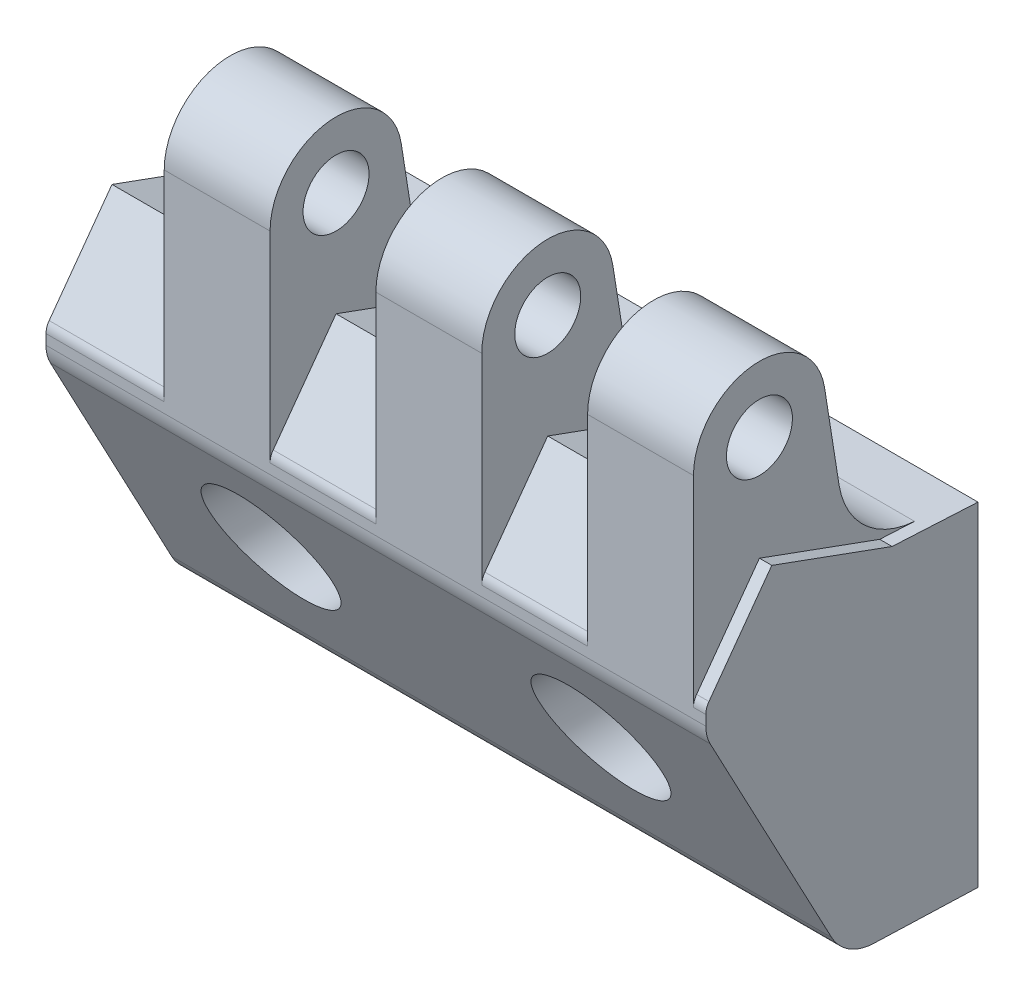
ISO-10303-21;
HEADER;
FILE_DESCRIPTION(('STEP AP214'),'2;1');
FILE_NAME('part.step','',(''),(''),'','','');
FILE_SCHEMA(('AUTOMOTIVE_DESIGN { 1 0 10303 214 1 1 1 1 }'));
ENDSEC;
DATA;
#1=APPLICATION_CONTEXT('core data for automotive mechanical design processes');
#2=APPLICATION_PROTOCOL_DEFINITION('international standard','automotive_design',2000,#1);
#3=PRODUCT_CONTEXT('',#1,'mechanical');
#4=PRODUCT('Part','Part','',(#3));
#5=PRODUCT_RELATED_PRODUCT_CATEGORY('part','',(#4));
#6=PRODUCT_DEFINITION_FORMATION('','',#4);
#7=PRODUCT_DEFINITION_CONTEXT('part definition',#1,'design');
#8=PRODUCT_DEFINITION('design','',#6,#7);
#9=PRODUCT_DEFINITION_SHAPE('','',#8);
#10=(LENGTH_UNIT() NAMED_UNIT(*) SI_UNIT(.MILLI.,.METRE.));
#11=(NAMED_UNIT(*) PLANE_ANGLE_UNIT() SI_UNIT($,.RADIAN.));
#12=(NAMED_UNIT(*) SI_UNIT($,.STERADIAN.) SOLID_ANGLE_UNIT());
#13=UNCERTAINTY_MEASURE_WITH_UNIT(LENGTH_MEASURE(1.E-05),#10,'distance_accuracy_value','');
#14=(GEOMETRIC_REPRESENTATION_CONTEXT(3) GLOBAL_UNCERTAINTY_ASSIGNED_CONTEXT((#13)) GLOBAL_UNIT_ASSIGNED_CONTEXT((#10,
#11,#12)) REPRESENTATION_CONTEXT('',''));
#15=CARTESIAN_POINT('',(0.,0.,0.));
#16=DIRECTION('',(0.,0.,1.));
#17=DIRECTION('',(1.,0.,0.));
#18=AXIS2_PLACEMENT_3D('',#15,#16,#17);
#19=CARTESIAN_POINT('',(-10.25,10.93,0.));
#20=DIRECTION('',(0.,0.998629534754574,-0.0523359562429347));
#21=DIRECTION('',(0.,0.0523359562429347,0.998629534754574));
#22=AXIS2_PLACEMENT_3D('',#19,#20,#21);
#23=PLANE('',#22);
#24=DIRECTION('',(1.,0.,0.));
#25=VECTOR('',#24,1.);
#26=CARTESIAN_POINT('',(-10.25,10.93,0.));
#27=LINE('',#26,#25);
#28=CARTESIAN_POINT('',(-10.,10.93,0.));
#29=VERTEX_POINT('',#28);
#30=CARTESIAN_POINT('',(30.,10.93,0.));
#31=VERTEX_POINT('',#30);
#32=EDGE_CURVE('E261',#29,#31,#27,.T.);
#33=ORIENTED_EDGE('',*,*,#32,.F.);
#34=DIRECTION('',(0.,-0.0523359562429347,-0.998629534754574));
#35=VECTOR('',#34,1.);
#36=CARTESIAN_POINT('',(-10.,11.2029078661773,5.2073922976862));
#37=LINE('',#36,#35);
#38=CARTESIAN_POINT('',(-10.,11.2029078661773,5.2073922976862));
#39=VERTEX_POINT('',#38);
#40=EDGE_CURVE('E243',#39,#29,#37,.T.);
#41=ORIENTED_EDGE('',*,*,#40,.F.);
#42=DIRECTION('',(1.,0.,0.));
#43=VECTOR('',#42,1.);
#44=CARTESIAN_POINT('',(-10.25,11.2029078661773,5.2073922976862));
#45=LINE('',#44,#43);
#46=CARTESIAN_POINT('',(-2.8333333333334,11.2029078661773,5.2073922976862));
#47=VERTEX_POINT('',#46);
#48=EDGE_CURVE('E265',#39,#47,#45,.T.);
#49=ORIENTED_EDGE('',*,*,#48,.T.);
#50=DIRECTION('',(0.,0.0523359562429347,0.998629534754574));
#51=VECTOR('',#50,1.);
#52=CARTESIAN_POINT('',(-2.8333333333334,10.93,0.));
#53=LINE('',#52,#51);
#54=CARTESIAN_POINT('',(-2.8333333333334,11.0922838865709,3.09656102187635));
#55=VERTEX_POINT('',#54);
#56=EDGE_CURVE('E409',#55,#47,#53,.T.);
#57=ORIENTED_EDGE('',*,*,#56,.F.);
#58=DIRECTION('',(1.,0.,0.));
#59=VECTOR('',#58,1.);
#60=CARTESIAN_POINT('',(-2.8333333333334,11.0922838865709,3.09656102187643));
#61=LINE('',#60,#59);
#62=CARTESIAN_POINT('',(3.5833333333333,11.0922838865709,3.09656102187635));
#63=VERTEX_POINT('',#62);
#64=EDGE_CURVE('E263',#63,#55,#61,.F.);
#65=ORIENTED_EDGE('',*,*,#64,.F.);
#66=DIRECTION('',(0.,0.0523359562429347,0.998629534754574));
#67=VECTOR('',#66,1.);
#68=CARTESIAN_POINT('',(3.5833333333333,10.93,0.));
#69=LINE('',#68,#67);
#70=CARTESIAN_POINT('',(3.5833333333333,11.2029078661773,5.2073922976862));
#71=VERTEX_POINT('',#70);
#72=EDGE_CURVE('E397',#63,#71,#69,.T.);
#73=ORIENTED_EDGE('',*,*,#72,.T.);
#74=CARTESIAN_POINT('',(10.,11.2029078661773,5.2073922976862));
#75=VERTEX_POINT('',#74);
#76=EDGE_CURVE('E311',#71,#75,#45,.T.);
#77=ORIENTED_EDGE('',*,*,#76,.T.);
#78=DIRECTION('',(0.,0.0523359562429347,0.998629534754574));
#79=VECTOR('',#78,1.);
#80=CARTESIAN_POINT('',(10.,10.93,0.));
#81=LINE('',#80,#79);
#82=CARTESIAN_POINT('',(10.,11.0922838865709,3.09656102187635));
#83=VERTEX_POINT('',#82);
#84=EDGE_CURVE('E458',#83,#75,#81,.T.);
#85=ORIENTED_EDGE('',*,*,#84,.F.);
#86=DIRECTION('',(-1.,0.,0.));
#87=VECTOR('',#86,1.);
#88=CARTESIAN_POINT('',(16.4166666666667,11.0922838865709,3.09656102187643));
#89=LINE('',#88,#87);
#90=CARTESIAN_POINT('',(16.4166666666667,11.0922838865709,3.09656102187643));
#91=VERTEX_POINT('',#90);
#92=EDGE_CURVE('E260',#83,#91,#89,.F.);
#93=ORIENTED_EDGE('',*,*,#92,.T.);
#94=DIRECTION('',(0.,0.0523359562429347,0.998629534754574));
#95=VECTOR('',#94,1.);
#96=CARTESIAN_POINT('',(16.4166666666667,10.93,0.));
#97=LINE('',#96,#95);
#98=CARTESIAN_POINT('',(16.4166666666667,11.2029078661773,5.2073922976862));
#99=VERTEX_POINT('',#98);
#100=EDGE_CURVE('E324',#91,#99,#97,.T.);
#101=ORIENTED_EDGE('',*,*,#100,.T.);
#102=CARTESIAN_POINT('',(22.833333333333,11.2029078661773,5.2073922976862));
#103=VERTEX_POINT('',#102);
#104=EDGE_CURVE('E312',#99,#103,#45,.T.);
#105=ORIENTED_EDGE('',*,*,#104,.T.);
#106=DIRECTION('',(0.,0.0523359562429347,0.998629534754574));
#107=VECTOR('',#106,1.);
#108=CARTESIAN_POINT('',(22.833333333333,10.93,0.));
#109=LINE('',#108,#107);
#110=CARTESIAN_POINT('',(22.833333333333,11.0922838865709,3.09656102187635));
#111=VERTEX_POINT('',#110);
#112=EDGE_CURVE('E321',#111,#103,#109,.T.);
#113=ORIENTED_EDGE('',*,*,#112,.F.);
#114=DIRECTION('',(-1.,0.,0.));
#115=VECTOR('',#114,1.);
#116=CARTESIAN_POINT('',(29.25,11.0922838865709,3.09656102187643));
#117=LINE('',#116,#115);
#118=CARTESIAN_POINT('',(29.25,11.0922838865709,3.09656102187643));
#119=VERTEX_POINT('',#118);
#120=EDGE_CURVE('E270',#111,#119,#117,.F.);
#121=ORIENTED_EDGE('',*,*,#120,.T.);
#122=DIRECTION('',(0.,0.0523359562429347,0.998629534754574));
#123=VECTOR('',#122,1.);
#124=CARTESIAN_POINT('',(29.25,10.93,0.));
#125=LINE('',#124,#123);
#126=CARTESIAN_POINT('',(29.25,11.2029078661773,5.2073922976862));
#127=VERTEX_POINT('',#126);
#128=EDGE_CURVE('E347',#119,#127,#125,.T.);
#129=ORIENTED_EDGE('',*,*,#128,.T.);
#130=CARTESIAN_POINT('',(30.,11.2029078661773,5.2073922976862));
#131=VERTEX_POINT('',#130);
#132=EDGE_CURVE('E308',#127,#131,#45,.T.);
#133=ORIENTED_EDGE('',*,*,#132,.T.);
#134=DIRECTION('',(0.,0.0523359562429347,0.998629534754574));
#135=VECTOR('',#134,1.);
#136=CARTESIAN_POINT('',(30.,10.93,0.));
#137=LINE('',#136,#135);
#138=EDGE_CURVE('E476',#31,#131,#137,.T.);
#139=ORIENTED_EDGE('',*,*,#138,.F.);
#140=EDGE_LOOP('',(#33,#41,#49,#57,#65,#73,#77,#85,#93,#101,#105,#113,#121,#129,#133,#139));
#141=FACE_BOUND('',#140,.T.);
#142=ADVANCED_FACE('F16',(#141),#23,.T.);
#143=CARTESIAN_POINT('',(-10.25,-9.07892726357,6.330694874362));
#144=DIRECTION('',(0.,-0.999390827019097,0.0348994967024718));
#145=DIRECTION('',(0.,-0.0348994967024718,-0.999390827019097));
#146=AXIS2_PLACEMENT_3D('',#143,#144,#145);
#147=PLANE('',#146);
#148=DIRECTION('',(1.,0.,0.));
#149=VECTOR('',#148,1.);
#150=CARTESIAN_POINT('',(-10.25,-9.07892726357,6.330694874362));
#151=LINE('',#150,#149);
#152=CARTESIAN_POINT('',(-10.,-9.07892726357,6.330694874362));
#153=VERTEX_POINT('',#152);
#154=CARTESIAN_POINT('',(30.,-9.07892726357,6.330694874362));
#155=VERTEX_POINT('',#154);
#156=EDGE_CURVE('E253',#153,#155,#151,.T.);
#157=ORIENTED_EDGE('',*,*,#156,.F.);
#158=DIRECTION('',(0.,0.0348994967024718,0.999390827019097));
#159=VECTOR('',#158,1.);
#160=CARTESIAN_POINT('',(-10.,-9.3,0.));
#161=LINE('',#160,#159);
#162=CARTESIAN_POINT('',(-10.,-9.3,0.));
#163=VERTEX_POINT('',#162);
#164=EDGE_CURVE('E240',#163,#153,#161,.T.);
#165=ORIENTED_EDGE('',*,*,#164,.F.);
#166=DIRECTION('',(1.,0.,0.));
#167=VECTOR('',#166,1.);
#168=CARTESIAN_POINT('',(-10.25,-9.3,0.));
#169=LINE('',#168,#167);
#170=CARTESIAN_POINT('',(30.,-9.3,0.));
#171=VERTEX_POINT('',#170);
#172=EDGE_CURVE('E251',#163,#171,#169,.T.);
#173=ORIENTED_EDGE('',*,*,#172,.T.);
#174=DIRECTION('',(0.,-0.0348994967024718,-0.999390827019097));
#175=VECTOR('',#174,1.);
#176=CARTESIAN_POINT('',(30.,-9.07892726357,6.330694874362));
#177=LINE('',#176,#175);
#178=EDGE_CURVE('E473',#155,#171,#177,.T.);
#179=ORIENTED_EDGE('',*,*,#178,.F.);
#180=EDGE_LOOP('',(#157,#165,#173,#179));
#181=FACE_BOUND('',#180,.T.);
#182=ADVANCED_FACE('F18',(#181),#147,.T.);
#183=CARTESIAN_POINT('',(-10.25,-9.3,0.));
#184=DIRECTION('',(0.,0.,-1.));
#185=DIRECTION('',(-1.,0.,0.));
#186=AXIS2_PLACEMENT_3D('',#183,#184,#185);
#187=PLANE('',#186);
#188=CARTESIAN_POINT('',(0.,0.,0.));
#189=DIRECTION('',(0.,0.,1.));
#190=DIRECTION('',(0.,-1.,0.));
#191=AXIS2_PLACEMENT_3D('',#188,#189,#190);
#192=CIRCLE('',#191,2.25);
#193=CARTESIAN_POINT('',(0.,-2.25,0.));
#194=VERTEX_POINT('',#193);
#195=EDGE_CURVE('E492',#194,#194,#192,.T.);
#196=ORIENTED_EDGE('',*,*,#195,.T.);
#197=EDGE_LOOP('',(#196));
#198=FACE_BOUND('',#197,.T.);
#199=CARTESIAN_POINT('',(20.,0.,0.));
#200=DIRECTION('',(0.,0.,1.));
#201=DIRECTION('',(0.,-1.,0.));
#202=AXIS2_PLACEMENT_3D('',#199,#200,#201);
#203=CIRCLE('',#202,2.25);
#204=CARTESIAN_POINT('',(20.,-2.25,0.));
#205=VERTEX_POINT('',#204);
#206=EDGE_CURVE('E502',#205,#205,#203,.T.);
#207=ORIENTED_EDGE('',*,*,#206,.T.);
#208=EDGE_LOOP('',(#207));
#209=FACE_BOUND('',#208,.T.);
#210=ORIENTED_EDGE('',*,*,#172,.F.);
#211=DIRECTION('',(0.,-1.,0.));
#212=VECTOR('',#211,1.);
#213=CARTESIAN_POINT('',(-10.,10.93,0.));
#214=LINE('',#213,#212);
#215=EDGE_CURVE('E237',#29,#163,#214,.T.);
#216=ORIENTED_EDGE('',*,*,#215,.F.);
#217=ORIENTED_EDGE('',*,*,#32,.T.);
#218=DIRECTION('',(0.,1.,0.));
#219=VECTOR('',#218,1.);
#220=CARTESIAN_POINT('',(30.,-9.3,0.));
#221=LINE('',#220,#219);
#222=EDGE_CURVE('E259',#171,#31,#221,.T.);
#223=ORIENTED_EDGE('',*,*,#222,.F.);
#224=EDGE_LOOP('',(#210,#216,#217,#223));
#225=FACE_BOUND('',#224,.T.);
#226=ADVANCED_FACE('F257',(#198,#209,#225),#187,.T.);
#227=CARTESIAN_POINT('',(-10.25,8.026752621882,16.5));
#228=DIRECTION('',(0.,0.,1.));
#229=DIRECTION('',(1.,0.,0.));
#230=AXIS2_PLACEMENT_3D('',#227,#228,#229);
#231=PLANE('',#230);
#232=DIRECTION('',(1.,0.,0.));
#233=VECTOR('',#232,1.);
#234=CARTESIAN_POINT('',(-10.25,8.026752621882,16.5));
#235=LINE('',#234,#233);
#236=CARTESIAN_POINT('',(-10.,8.026752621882,16.5));
#237=VERTEX_POINT('',#236);
#238=CARTESIAN_POINT('',(-2.8333333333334,8.026752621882,16.5));
#239=VERTEX_POINT('',#238);
#240=EDGE_CURVE('E297',#237,#239,#235,.T.);
#241=ORIENTED_EDGE('',*,*,#240,.F.);
#242=DIRECTION('',(0.,1.,0.));
#243=VECTOR('',#242,1.);
#244=CARTESIAN_POINT('',(-10.,7.41266032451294,16.5));
#245=LINE('',#244,#243);
#246=CARTESIAN_POINT('',(-10.,7.41266032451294,16.5));
#247=VERTEX_POINT('',#246);
#248=EDGE_CURVE('E31',#247,#237,#245,.T.);
#249=ORIENTED_EDGE('',*,*,#248,.F.);
#250=DIRECTION('',(1.,0.,0.));
#251=VECTOR('',#250,1.);
#252=CARTESIAN_POINT('',(-10.25,7.412660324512,16.5));
#253=LINE('',#252,#251);
#254=CARTESIAN_POINT('',(30.,7.412660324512,16.5));
#255=VERTEX_POINT('',#254);
#256=EDGE_CURVE('E290',#247,#255,#253,.T.);
#257=ORIENTED_EDGE('',*,*,#256,.T.);
#258=DIRECTION('',(0.,-1.,0.));
#259=VECTOR('',#258,1.);
#260=CARTESIAN_POINT('',(30.,8.026752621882,16.5));
#261=LINE('',#260,#259);
#262=CARTESIAN_POINT('',(30.,8.026752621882,16.5));
#263=VERTEX_POINT('',#262);
#264=EDGE_CURVE('E487',#263,#255,#261,.T.);
#265=ORIENTED_EDGE('',*,*,#264,.F.);
#266=CARTESIAN_POINT('',(29.25,8.026752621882,16.5));
#267=VERTEX_POINT('',#266);
#268=EDGE_CURVE('E292',#267,#263,#235,.T.);
#269=ORIENTED_EDGE('',*,*,#268,.F.);
#270=DIRECTION('',(0.,-1.,0.));
#271=VECTOR('',#270,1.);
#272=CARTESIAN_POINT('',(29.25,20.2,16.5));
#273=LINE('',#272,#271);
#274=CARTESIAN_POINT('',(29.25,20.2,16.5));
#275=VERTEX_POINT('',#274);
#276=EDGE_CURVE('E527',#275,#267,#273,.T.);
#277=ORIENTED_EDGE('',*,*,#276,.F.);
#278=DIRECTION('',(-1.,0.,0.));
#279=VECTOR('',#278,1.);
#280=CARTESIAN_POINT('',(29.25,20.2,16.5));
#281=LINE('',#280,#279);
#282=CARTESIAN_POINT('',(22.833333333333,20.2,16.5));
#283=VERTEX_POINT('',#282);
#284=EDGE_CURVE('E539',#275,#283,#281,.T.);
#285=ORIENTED_EDGE('',*,*,#284,.T.);
#286=DIRECTION('',(0.,-1.,0.));
#287=VECTOR('',#286,1.);
#288=CARTESIAN_POINT('',(22.833333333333,20.2,16.5));
#289=LINE('',#288,#287);
#290=CARTESIAN_POINT('',(22.833333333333,8.026752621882,16.5));
#291=VERTEX_POINT('',#290);
#292=EDGE_CURVE('E511',#283,#291,#289,.T.);
#293=ORIENTED_EDGE('',*,*,#292,.T.);
#294=CARTESIAN_POINT('',(16.4166666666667,8.026752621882,16.5));
#295=VERTEX_POINT('',#294);
#296=EDGE_CURVE('E301',#295,#291,#235,.T.);
#297=ORIENTED_EDGE('',*,*,#296,.F.);
#298=DIRECTION('',(0.,-1.,0.));
#299=VECTOR('',#298,1.);
#300=CARTESIAN_POINT('',(16.4166666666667,20.2,16.5));
#301=LINE('',#300,#299);
#302=CARTESIAN_POINT('',(16.4166666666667,20.2,16.5));
#303=VERTEX_POINT('',#302);
#304=EDGE_CURVE('E428',#303,#295,#301,.T.);
#305=ORIENTED_EDGE('',*,*,#304,.F.);
#306=DIRECTION('',(-1.,0.,0.));
#307=VECTOR('',#306,1.);
#308=CARTESIAN_POINT('',(16.4166666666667,20.2,16.5));
#309=LINE('',#308,#307);
#310=CARTESIAN_POINT('',(10.,20.2,16.5));
#311=VERTEX_POINT('',#310);
#312=EDGE_CURVE('E440',#303,#311,#309,.T.);
#313=ORIENTED_EDGE('',*,*,#312,.T.);
#314=DIRECTION('',(0.,-1.,0.));
#315=VECTOR('',#314,1.);
#316=CARTESIAN_POINT('',(10.,20.2,16.5));
#317=LINE('',#316,#315);
#318=CARTESIAN_POINT('',(10.,8.026752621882,16.5));
#319=VERTEX_POINT('',#318);
#320=EDGE_CURVE('E411',#311,#319,#317,.T.);
#321=ORIENTED_EDGE('',*,*,#320,.T.);
#322=CARTESIAN_POINT('',(3.5833333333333,8.026752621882,16.5));
#323=VERTEX_POINT('',#322);
#324=EDGE_CURVE('E300',#323,#319,#235,.T.);
#325=ORIENTED_EDGE('',*,*,#324,.F.);
#326=DIRECTION('',(0.,-1.,0.));
#327=VECTOR('',#326,1.);
#328=CARTESIAN_POINT('',(3.5833333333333,20.2,16.5));
#329=LINE('',#328,#327);
#330=CARTESIAN_POINT('',(3.5833333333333,20.2,16.5));
#331=VERTEX_POINT('',#330);
#332=EDGE_CURVE('E349',#331,#323,#329,.T.);
#333=ORIENTED_EDGE('',*,*,#332,.F.);
#334=DIRECTION('',(1.,0.,0.));
#335=VECTOR('',#334,1.);
#336=CARTESIAN_POINT('',(-2.8333333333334,20.2,16.5));
#337=LINE('',#336,#335);
#338=CARTESIAN_POINT('',(-2.8333333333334,20.2,16.5));
#339=VERTEX_POINT('',#338);
#340=EDGE_CURVE('E381',#339,#331,#337,.T.);
#341=ORIENTED_EDGE('',*,*,#340,.F.);
#342=DIRECTION('',(0.,-1.,0.));
#343=VECTOR('',#342,1.);
#344=CARTESIAN_POINT('',(-2.8333333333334,20.2,16.5));
#345=LINE('',#344,#343);
#346=EDGE_CURVE('E367',#339,#239,#345,.T.);
#347=ORIENTED_EDGE('',*,*,#346,.T.);
#348=EDGE_LOOP('',(#241,#249,#257,#265,#269,#277,#285,#293,#297,#305,#313,#321,#325,#333,#341,#347));
#349=FACE_BOUND('',#348,.T.);
#350=ADVANCED_FACE('F586',(#349),#231,.T.);
#351=CARTESIAN_POINT('',(-10.25,7.41266032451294,14.2499999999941));
#352=DIRECTION('',(1.,0.,0.));
#353=DIRECTION('',(0.,1.,0.));
#354=AXIS2_PLACEMENT_3D('',#351,#352,#353);
#355=CYLINDRICAL_SURFACE('',#354,2.25000000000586);
#356=ORIENTED_EDGE('',*,*,#256,.F.);
#357=CARTESIAN_POINT('',(-10.,7.41266032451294,14.2499999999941));
#358=DIRECTION('',(-1.,0.,0.));
#359=DIRECTION('',(0.,0.,1.));
#360=AXIS2_PLACEMENT_3D('',#357,#358,#359);
#361=CIRCLE('',#360,2.25000000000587);
#362=CARTESIAN_POINT('',(-10.,6.356349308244,16.236632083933));
#363=VERTEX_POINT('',#362);
#364=EDGE_CURVE('E657',#363,#247,#361,.T.);
#365=ORIENTED_EDGE('',*,*,#364,.F.);
#366=DIRECTION('',(1.,0.,0.));
#367=VECTOR('',#366,1.);
#368=CARTESIAN_POINT('',(-10.25,6.356349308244,16.236632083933));
#369=LINE('',#368,#367);
#370=CARTESIAN_POINT('',(30.,6.356349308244,16.236632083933));
#371=VERTEX_POINT('',#370);
#372=EDGE_CURVE('E283',#363,#371,#369,.T.);
#373=ORIENTED_EDGE('',*,*,#372,.T.);
#374=CARTESIAN_POINT('',(30.,7.41266032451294,14.2499999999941));
#375=DIRECTION('',(1.,0.,0.));
#376=DIRECTION('',(0.,0.,-1.));
#377=AXIS2_PLACEMENT_3D('',#374,#375,#376);
#378=CIRCLE('',#377,2.25000000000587);
#379=EDGE_CURVE('E490',#255,#371,#378,.T.);
#380=ORIENTED_EDGE('',*,*,#379,.F.);
#381=EDGE_LOOP('',(#356,#365,#373,#380));
#382=FACE_BOUND('',#381,.T.);
#383=ADVANCED_FACE('F279',(#382),#355,.T.);
#384=CARTESIAN_POINT('',(-10.25,6.356349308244,16.236632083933));
#385=DIRECTION('',(0.,-0.469471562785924,0.882947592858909));
#386=DIRECTION('',(0.,-0.882947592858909,-0.469471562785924));
#387=AXIS2_PLACEMENT_3D('',#384,#385,#386);
#388=PLANE('',#387);
#389=CARTESIAN_POINT('',(0.,0.,12.8569012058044));
#390=DIRECTION('',(0.,-0.469471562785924,0.882947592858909));
#391=DIRECTION('',(0.,0.882947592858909,0.469471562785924));
#392=AXIS2_PLACEMENT_3D('',#389,#390,#391);
#393=ELLIPSE('',#392,4.24713769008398,3.75);
#394=CARTESIAN_POINT('',(0.,3.75,14.8508115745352));
#395=VERTEX_POINT('',#394);
#396=EDGE_CURVE('E10',#395,#395,#393,.T.);
#397=ORIENTED_EDGE('',*,*,#396,.F.);
#398=EDGE_LOOP('',(#397));
#399=FACE_BOUND('',#398,.T.);
#400=CARTESIAN_POINT('',(20.,0.,12.8569012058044));
#401=DIRECTION('',(0.,-0.469471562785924,0.882947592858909));
#402=DIRECTION('',(0.,0.882947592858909,0.469471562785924));
#403=AXIS2_PLACEMENT_3D('',#400,#401,#402);
#404=ELLIPSE('',#403,4.24713769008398,3.75);
#405=CARTESIAN_POINT('',(20.,3.75,14.8508115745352));
#406=VERTEX_POINT('',#405);
#407=EDGE_CURVE('E24',#406,#406,#404,.T.);
#408=ORIENTED_EDGE('',*,*,#407,.F.);
#409=EDGE_LOOP('',(#408));
#410=FACE_BOUND('',#409,.T.);
#411=ORIENTED_EDGE('',*,*,#372,.F.);
#412=DIRECTION('',(0.,0.882947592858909,0.469471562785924));
#413=VECTOR('',#412,1.);
#414=CARTESIAN_POINT('',(-10.,-7.48916947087,8.8748391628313));
#415=LINE('',#414,#413);
#416=CARTESIAN_POINT('',(-10.,-7.48916947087,8.8748391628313));
#417=VERTEX_POINT('',#416);
#418=EDGE_CURVE('E284',#417,#363,#415,.T.);
#419=ORIENTED_EDGE('',*,*,#418,.F.);
#420=DIRECTION('',(1.,0.,0.));
#421=VECTOR('',#420,1.);
#422=CARTESIAN_POINT('',(-10.25,-7.48916947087,8.8748391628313));
#423=LINE('',#422,#421);
#424=CARTESIAN_POINT('',(30.,-7.48916947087,8.8748391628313));
#425=VERTEX_POINT('',#424);
#426=EDGE_CURVE('E39',#417,#425,#423,.T.);
#427=ORIENTED_EDGE('',*,*,#426,.T.);
#428=DIRECTION('',(0.,-0.882947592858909,-0.469471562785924));
#429=VECTOR('',#428,1.);
#430=CARTESIAN_POINT('',(30.,6.356349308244,16.236632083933));
#431=LINE('',#430,#429);
#432=EDGE_CURVE('E285',#371,#425,#431,.T.);
#433=ORIENTED_EDGE('',*,*,#432,.F.);
#434=EDGE_LOOP('',(#411,#419,#427,#433));
#435=FACE_BOUND('',#434,.T.);
#436=ADVANCED_FACE('F276',(#399,#410,#435),#388,.T.);
#437=CARTESIAN_POINT('',(-10.25,-6.08075478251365,6.22599638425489));
#438=DIRECTION('',(1.,0.,0.));
#439=DIRECTION('',(0.,1.,0.));
#440=AXIS2_PLACEMENT_3D('',#437,#438,#439);
#441=CYLINDRICAL_SURFACE('',#440,2.99999999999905);
#442=ORIENTED_EDGE('',*,*,#426,.F.);
#443=CARTESIAN_POINT('',(-10.,-6.08075478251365,6.22599638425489));
#444=DIRECTION('',(-1.,0.,0.));
#445=DIRECTION('',(0.,0.,1.));
#446=AXIS2_PLACEMENT_3D('',#443,#444,#445);
#447=CIRCLE('',#446,2.99999999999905);
#448=EDGE_CURVE('E254',#153,#417,#447,.T.);
#449=ORIENTED_EDGE('',*,*,#448,.F.);
#450=ORIENTED_EDGE('',*,*,#156,.T.);
#451=CARTESIAN_POINT('',(30.,-6.08075478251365,6.22599638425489));
#452=DIRECTION('',(1.,0.,0.));
#453=DIRECTION('',(0.,0.,-1.));
#454=AXIS2_PLACEMENT_3D('',#451,#452,#453);
#455=CIRCLE('',#454,2.99999999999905);
#456=EDGE_CURVE('E470',#425,#155,#455,.T.);
#457=ORIENTED_EDGE('',*,*,#456,.F.);
#458=EDGE_LOOP('',(#442,#449,#450,#457));
#459=FACE_BOUND('',#458,.T.);
#460=ADVANCED_FACE('F278',(#459),#441,.T.);
#461=CARTESIAN_POINT('',(-10.25,11.2029078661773,5.2073922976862));
#462=DIRECTION('',(0.,0.939692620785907,-0.342020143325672));
#463=DIRECTION('',(0.,0.342020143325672,0.939692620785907));
#464=AXIS2_PLACEMENT_3D('',#461,#462,#463);
#465=PLANE('',#464);
#466=ORIENTED_EDGE('',*,*,#48,.F.);
#467=DIRECTION('',(0.,-0.342020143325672,-0.939692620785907));
#468=VECTOR('',#467,1.);
#469=CARTESIAN_POINT('',(-10.,13.8572,12.5));
#470=LINE('',#469,#468);
#471=CARTESIAN_POINT('',(-10.,13.8572,12.5));
#472=VERTEX_POINT('',#471);
#473=EDGE_CURVE('E1480',#472,#39,#470,.T.);
#474=ORIENTED_EDGE('',*,*,#473,.F.);
#475=DIRECTION('',(1.,0.,0.));
#476=VECTOR('',#475,1.);
#477=CARTESIAN_POINT('',(-10.25,13.8572,12.5));
#478=LINE('',#477,#476);
#479=CARTESIAN_POINT('',(-2.8333333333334,13.8572,12.5));
#480=VERTEX_POINT('',#479);
#481=EDGE_CURVE('E307',#472,#480,#478,.T.);
#482=ORIENTED_EDGE('',*,*,#481,.T.);
#483=DIRECTION('',(0.,0.342020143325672,0.939692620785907));
#484=VECTOR('',#483,1.);
#485=CARTESIAN_POINT('',(-2.8333333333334,11.2029078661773,5.2073922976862));
#486=LINE('',#485,#484);
#487=EDGE_CURVE('E406',#47,#480,#486,.T.);
#488=ORIENTED_EDGE('',*,*,#487,.F.);
#489=EDGE_LOOP('',(#466,#474,#482,#488));
#490=FACE_BOUND('',#489,.T.);
#491=ADVANCED_FACE('F692',(#490),#465,.T.);
#492=CARTESIAN_POINT('',(-10.25,13.8572,12.5));
#493=DIRECTION('',(0.,0.587785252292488,0.809016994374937));
#494=DIRECTION('',(0.,-0.809016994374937,0.587785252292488));
#495=AXIS2_PLACEMENT_3D('',#492,#493,#494);
#496=PLANE('',#495);
#497=ORIENTED_EDGE('',*,*,#481,.F.);
#498=DIRECTION('',(0.,0.809016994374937,-0.587785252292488));
#499=VECTOR('',#498,1.);
#500=CARTESIAN_POINT('',(-10.,8.614537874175,16.309016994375));
#501=LINE('',#500,#499);
#502=CARTESIAN_POINT('',(-10.,8.614537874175,16.309016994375));
#503=VERTEX_POINT('',#502);
#504=EDGE_CURVE('E1477',#503,#472,#501,.T.);
#505=ORIENTED_EDGE('',*,*,#504,.F.);
#506=DIRECTION('',(1.,0.,0.));
#507=VECTOR('',#506,1.);
#508=CARTESIAN_POINT('',(-10.25,8.614537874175,16.309016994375));
#509=LINE('',#508,#507);
#510=CARTESIAN_POINT('',(-2.8333333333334,8.614537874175,16.309016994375));
#511=VERTEX_POINT('',#510);
#512=EDGE_CURVE('E302',#503,#511,#509,.T.);
#513=ORIENTED_EDGE('',*,*,#512,.T.);
#514=DIRECTION('',(0.,-0.809016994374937,0.587785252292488));
#515=VECTOR('',#514,1.);
#516=CARTESIAN_POINT('',(-2.8333333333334,13.8572,12.5));
#517=LINE('',#516,#515);
#518=EDGE_CURVE('E403',#480,#511,#517,.T.);
#519=ORIENTED_EDGE('',*,*,#518,.F.);
#520=EDGE_LOOP('',(#497,#505,#513,#519));
#521=FACE_BOUND('',#520,.T.);
#522=ADVANCED_FACE('F849',(#521),#496,.T.);
#523=CARTESIAN_POINT('',(-10.25,8.02675262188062,15.4999999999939));
#524=DIRECTION('',(1.,0.,0.));
#525=DIRECTION('',(0.,1.,0.));
#526=AXIS2_PLACEMENT_3D('',#523,#524,#525);
#527=CYLINDRICAL_SURFACE('',#526,1.00000000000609);
#528=ORIENTED_EDGE('',*,*,#512,.F.);
#529=CARTESIAN_POINT('',(-10.,8.02675262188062,15.4999999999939));
#530=DIRECTION('',(-1.,0.,0.));
#531=DIRECTION('',(0.,0.,1.));
#532=AXIS2_PLACEMENT_3D('',#529,#530,#531);
#533=CIRCLE('',#532,1.0000000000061);
#534=EDGE_CURVE('E655',#237,#503,#533,.T.);
#535=ORIENTED_EDGE('',*,*,#534,.F.);
#536=ORIENTED_EDGE('',*,*,#240,.T.);
#537=CARTESIAN_POINT('',(-2.8333333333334,8.02675262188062,15.4999999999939));
#538=DIRECTION('',(-1.,0.,0.));
#539=DIRECTION('',(0.,-1.,0.));
#540=AXIS2_PLACEMENT_3D('',#537,#538,#539);
#541=CIRCLE('',#540,1.00000000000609);
#542=EDGE_CURVE('E400',#511,#239,#541,.F.);
#543=ORIENTED_EDGE('',*,*,#542,.F.);
#544=EDGE_LOOP('',(#528,#535,#536,#543));
#545=FACE_BOUND('',#544,.T.);
#546=ADVANCED_FACE('F654',(#545),#527,.T.);
#547=CARTESIAN_POINT('',(29.25,13.8572,12.5));
#548=VERTEX_POINT('',#547);
#549=CARTESIAN_POINT('',(30.,13.8572,12.5));
#550=VERTEX_POINT('',#549);
#551=EDGE_CURVE('E304',#548,#550,#478,.T.);
#552=ORIENTED_EDGE('',*,*,#551,.T.);
#553=DIRECTION('',(0.,0.342020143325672,0.939692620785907));
#554=VECTOR('',#553,1.);
#555=CARTESIAN_POINT('',(30.,11.2029078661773,5.2073922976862));
#556=LINE('',#555,#554);
#557=EDGE_CURVE('E481',#131,#550,#556,.T.);
#558=ORIENTED_EDGE('',*,*,#557,.F.);
#559=ORIENTED_EDGE('',*,*,#132,.F.);
#560=DIRECTION('',(0.,0.342020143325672,0.939692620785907));
#561=VECTOR('',#560,1.);
#562=CARTESIAN_POINT('',(29.25,11.2029078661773,5.2073922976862));
#563=LINE('',#562,#561);
#564=EDGE_CURVE('E345',#127,#548,#563,.T.);
#565=ORIENTED_EDGE('',*,*,#564,.T.);
#566=EDGE_LOOP('',(#552,#558,#559,#565));
#567=FACE_BOUND('',#566,.T.);
#568=ADVANCED_FACE('F563',(#567),#465,.T.);
#569=CARTESIAN_POINT('',(29.25,8.614537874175,16.309016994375));
#570=VERTEX_POINT('',#569);
#571=CARTESIAN_POINT('',(30.,8.614537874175,16.309016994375));
#572=VERTEX_POINT('',#571);
#573=EDGE_CURVE('E299',#570,#572,#509,.T.);
#574=ORIENTED_EDGE('',*,*,#573,.T.);
#575=DIRECTION('',(0.,-0.809016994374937,0.587785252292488));
#576=VECTOR('',#575,1.);
#577=CARTESIAN_POINT('',(30.,13.8572,12.5));
#578=LINE('',#577,#576);
#579=EDGE_CURVE('E483',#550,#572,#578,.T.);
#580=ORIENTED_EDGE('',*,*,#579,.F.);
#581=ORIENTED_EDGE('',*,*,#551,.F.);
#582=DIRECTION('',(0.,-0.809016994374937,0.587785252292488));
#583=VECTOR('',#582,1.);
#584=CARTESIAN_POINT('',(29.25,13.8572,12.5));
#585=LINE('',#584,#583);
#586=EDGE_CURVE('E338',#548,#570,#585,.T.);
#587=ORIENTED_EDGE('',*,*,#586,.T.);
#588=EDGE_LOOP('',(#574,#580,#581,#587));
#589=FACE_BOUND('',#588,.T.);
#590=ADVANCED_FACE('F570',(#589),#496,.T.);
#591=ORIENTED_EDGE('',*,*,#268,.T.);
#592=CARTESIAN_POINT('',(30.,8.02675262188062,15.4999999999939));
#593=DIRECTION('',(1.,0.,0.));
#594=DIRECTION('',(0.,0.,-1.));
#595=AXIS2_PLACEMENT_3D('',#592,#593,#594);
#596=CIRCLE('',#595,1.0000000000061);
#597=EDGE_CURVE('E485',#572,#263,#596,.T.);
#598=ORIENTED_EDGE('',*,*,#597,.F.);
#599=ORIENTED_EDGE('',*,*,#573,.F.);
#600=CARTESIAN_POINT('',(29.25,8.02675262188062,15.4999999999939));
#601=DIRECTION('',(-1.,0.,0.));
#602=DIRECTION('',(0.,-1.,0.));
#603=AXIS2_PLACEMENT_3D('',#600,#601,#602);
#604=CIRCLE('',#603,1.00000000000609);
#605=EDGE_CURVE('E336',#570,#267,#604,.F.);
#606=ORIENTED_EDGE('',*,*,#605,.T.);
#607=EDGE_LOOP('',(#591,#598,#599,#606));
#608=FACE_BOUND('',#607,.T.);
#609=ADVANCED_FACE('F581',(#608),#527,.T.);
#610=ORIENTED_EDGE('',*,*,#76,.F.);
#611=DIRECTION('',(0.,0.342020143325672,0.939692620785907));
#612=VECTOR('',#611,1.);
#613=CARTESIAN_POINT('',(3.5833333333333,11.2029078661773,5.2073922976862));
#614=LINE('',#613,#612);
#615=CARTESIAN_POINT('',(3.5833333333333,13.8572,12.5));
#616=VERTEX_POINT('',#615);
#617=EDGE_CURVE('E394',#71,#616,#614,.T.);
#618=ORIENTED_EDGE('',*,*,#617,.T.);
#619=CARTESIAN_POINT('',(10.,13.8572,12.5));
#620=VERTEX_POINT('',#619);
#621=EDGE_CURVE('E309',#616,#620,#478,.T.);
#622=ORIENTED_EDGE('',*,*,#621,.T.);
#623=DIRECTION('',(0.,0.342020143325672,0.939692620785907));
#624=VECTOR('',#623,1.);
#625=CARTESIAN_POINT('',(10.,11.2029078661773,5.2073922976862));
#626=LINE('',#625,#624);
#627=EDGE_CURVE('E455',#75,#620,#626,.T.);
#628=ORIENTED_EDGE('',*,*,#627,.F.);
#629=EDGE_LOOP('',(#610,#618,#622,#628));
#630=FACE_BOUND('',#629,.T.);
#631=ADVANCED_FACE('F630',(#630),#465,.T.);
#632=ORIENTED_EDGE('',*,*,#621,.F.);
#633=DIRECTION('',(0.,-0.809016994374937,0.587785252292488));
#634=VECTOR('',#633,1.);
#635=CARTESIAN_POINT('',(3.5833333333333,13.8572,12.5));
#636=LINE('',#635,#634);
#637=CARTESIAN_POINT('',(3.5833333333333,8.614537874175,16.309016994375));
#638=VERTEX_POINT('',#637);
#639=EDGE_CURVE('E391',#616,#638,#636,.T.);
#640=ORIENTED_EDGE('',*,*,#639,.T.);
#641=CARTESIAN_POINT('',(10.,8.614537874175,16.309016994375));
#642=VERTEX_POINT('',#641);
#643=EDGE_CURVE('E305',#638,#642,#509,.T.);
#644=ORIENTED_EDGE('',*,*,#643,.T.);
#645=DIRECTION('',(0.,-0.809016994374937,0.587785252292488));
#646=VECTOR('',#645,1.);
#647=CARTESIAN_POINT('',(10.,13.8572,12.5));
#648=LINE('',#647,#646);
#649=EDGE_CURVE('E452',#620,#642,#648,.T.);
#650=ORIENTED_EDGE('',*,*,#649,.F.);
#651=EDGE_LOOP('',(#632,#640,#644,#650));
#652=FACE_BOUND('',#651,.T.);
#653=ADVANCED_FACE('F624',(#652),#496,.T.);
#654=ORIENTED_EDGE('',*,*,#643,.F.);
#655=CARTESIAN_POINT('',(3.5833333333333,8.02675262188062,15.4999999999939));
#656=DIRECTION('',(-1.,0.,0.));
#657=DIRECTION('',(0.,-1.,0.));
#658=AXIS2_PLACEMENT_3D('',#655,#656,#657);
#659=CIRCLE('',#658,1.00000000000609);
#660=EDGE_CURVE('E388',#638,#323,#659,.F.);
#661=ORIENTED_EDGE('',*,*,#660,.T.);
#662=ORIENTED_EDGE('',*,*,#324,.T.);
#663=CARTESIAN_POINT('',(10.,8.02675262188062,15.4999999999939));
#664=DIRECTION('',(-1.,0.,0.));
#665=DIRECTION('',(0.,-1.,0.));
#666=AXIS2_PLACEMENT_3D('',#663,#664,#665);
#667=CIRCLE('',#666,1.00000000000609);
#668=EDGE_CURVE('E449',#642,#319,#667,.F.);
#669=ORIENTED_EDGE('',*,*,#668,.F.);
#670=EDGE_LOOP('',(#654,#661,#662,#669));
#671=FACE_BOUND('',#670,.T.);
#672=ADVANCED_FACE('F591',(#671),#527,.T.);
#673=DIRECTION('',(0.,0.342020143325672,0.939692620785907));
#674=VECTOR('',#673,1.);
#675=CARTESIAN_POINT('',(22.833333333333,11.2029078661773,5.2073922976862));
#676=LINE('',#675,#674);
#677=CARTESIAN_POINT('',(22.833333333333,13.8572,12.5));
#678=VERTEX_POINT('',#677);
#679=EDGE_CURVE('E333',#103,#678,#676,.T.);
#680=ORIENTED_EDGE('',*,*,#679,.F.);
#681=ORIENTED_EDGE('',*,*,#104,.F.);
#682=DIRECTION('',(0.,0.342020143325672,0.939692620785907));
#683=VECTOR('',#682,1.);
#684=CARTESIAN_POINT('',(16.4166666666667,11.2029078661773,5.2073922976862));
#685=LINE('',#684,#683);
#686=CARTESIAN_POINT('',(16.4166666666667,13.8572,12.5));
#687=VERTEX_POINT('',#686);
#688=EDGE_CURVE('E465',#99,#687,#685,.T.);
#689=ORIENTED_EDGE('',*,*,#688,.T.);
#690=EDGE_CURVE('E310',#687,#678,#478,.T.);
#691=ORIENTED_EDGE('',*,*,#690,.T.);
#692=EDGE_LOOP('',(#680,#681,#689,#691));
#693=FACE_BOUND('',#692,.T.);
#694=ADVANCED_FACE('F558',(#693),#465,.T.);
#695=DIRECTION('',(0.,-0.809016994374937,0.587785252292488));
#696=VECTOR('',#695,1.);
#697=CARTESIAN_POINT('',(22.833333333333,13.8572,12.5));
#698=LINE('',#697,#696);
#699=CARTESIAN_POINT('',(22.833333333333,8.614537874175,16.309016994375));
#700=VERTEX_POINT('',#699);
#701=EDGE_CURVE('E340',#678,#700,#698,.T.);
#702=ORIENTED_EDGE('',*,*,#701,.F.);
#703=ORIENTED_EDGE('',*,*,#690,.F.);
#704=DIRECTION('',(0.,-0.809016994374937,0.587785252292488));
#705=VECTOR('',#704,1.);
#706=CARTESIAN_POINT('',(16.4166666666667,13.8572,12.5));
#707=LINE('',#706,#705);
#708=CARTESIAN_POINT('',(16.4166666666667,8.614537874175,16.309016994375));
#709=VERTEX_POINT('',#708);
#710=EDGE_CURVE('E463',#687,#709,#707,.T.);
#711=ORIENTED_EDGE('',*,*,#710,.T.);
#712=EDGE_CURVE('E306',#709,#700,#509,.T.);
#713=ORIENTED_EDGE('',*,*,#712,.T.);
#714=EDGE_LOOP('',(#702,#703,#711,#713));
#715=FACE_BOUND('',#714,.T.);
#716=ADVANCED_FACE('F555',(#715),#496,.T.);
#717=CARTESIAN_POINT('',(22.833333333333,8.02675262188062,15.4999999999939));
#718=DIRECTION('',(-1.,0.,0.));
#719=DIRECTION('',(0.,-1.,0.));
#720=AXIS2_PLACEMENT_3D('',#717,#718,#719);
#721=CIRCLE('',#720,1.00000000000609);
#722=EDGE_CURVE('E548',#700,#291,#721,.F.);
#723=ORIENTED_EDGE('',*,*,#722,.F.);
#724=ORIENTED_EDGE('',*,*,#712,.F.);
#725=CARTESIAN_POINT('',(16.4166666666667,8.02675262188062,15.4999999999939));
#726=DIRECTION('',(-1.,0.,0.));
#727=DIRECTION('',(0.,-1.,0.));
#728=AXIS2_PLACEMENT_3D('',#725,#726,#727);
#729=CIRCLE('',#728,1.00000000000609);
#730=EDGE_CURVE('E461',#709,#295,#729,.F.);
#731=ORIENTED_EDGE('',*,*,#730,.T.);
#732=ORIENTED_EDGE('',*,*,#296,.T.);
#733=EDGE_LOOP('',(#723,#724,#731,#732));
#734=FACE_BOUND('',#733,.T.);
#735=ADVANCED_FACE('F621',(#734),#527,.T.);
#736=CARTESIAN_POINT('',(16.4166666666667,16.0792045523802,2.735143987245));
#737=DIRECTION('',(-1.,0.,0.));
#738=DIRECTION('',(0.,-1.,0.));
#739=AXIS2_PLACEMENT_3D('',#736,#737,#738);
#740=CYLINDRICAL_SURFACE('',#739,4.99999999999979);
#741=ORIENTED_EDGE('',*,*,#92,.F.);
#742=CARTESIAN_POINT('',(10.,16.0792045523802,2.735143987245));
#743=DIRECTION('',(-1.,0.,0.));
#744=DIRECTION('',(0.,1.,0.));
#745=AXIS2_PLACEMENT_3D('',#742,#743,#744);
#746=CIRCLE('',#745,4.99999999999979);
#747=CARTESIAN_POINT('',(10.,15.2970322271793,7.6735856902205));
#748=VERTEX_POINT('',#747);
#749=EDGE_CURVE('E412',#83,#748,#746,.T.);
#750=ORIENTED_EDGE('',*,*,#749,.T.);
#751=DIRECTION('',(-1.,0.,0.));
#752=VECTOR('',#751,1.);
#753=CARTESIAN_POINT('',(16.4166666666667,15.2970322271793,7.6735856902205));
#754=LINE('',#753,#752);
#755=CARTESIAN_POINT('',(16.4166666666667,15.2970322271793,7.6735856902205));
#756=VERTEX_POINT('',#755);
#757=EDGE_CURVE('E446',#756,#748,#754,.T.);
#758=ORIENTED_EDGE('',*,*,#757,.F.);
#759=CARTESIAN_POINT('',(16.4166666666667,16.0792045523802,2.735143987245));
#760=DIRECTION('',(-1.,0.,0.));
#761=DIRECTION('',(0.,1.,0.));
#762=AXIS2_PLACEMENT_3D('',#759,#760,#761);
#763=CIRCLE('',#762,4.99999999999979);
#764=EDGE_CURVE('E429',#91,#756,#763,.T.);
#765=ORIENTED_EDGE('',*,*,#764,.F.);
#766=EDGE_LOOP('',(#741,#750,#758,#765));
#767=FACE_BOUND('',#766,.T.);
#768=ADVANCED_FACE('F615',(#767),#740,.F.);
#769=CARTESIAN_POINT('',(16.4166666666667,15.2970322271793,7.6735856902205));
#770=DIRECTION('',(0.,-0.15643446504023,0.987688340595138));
#771=DIRECTION('',(0.,-0.987688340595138,-0.15643446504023));
#772=AXIS2_PLACEMENT_3D('',#769,#770,#771);
#773=PLANE('',#772);
#774=DIRECTION('',(0.,0.987688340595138,0.15643446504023));
#775=VECTOR('',#774,1.);
#776=CARTESIAN_POINT('',(10.,15.2970322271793,7.6735856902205));
#777=LINE('',#776,#775);
#778=CARTESIAN_POINT('',(10.,20.8257378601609,8.5492466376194));
#779=VERTEX_POINT('',#778);
#780=EDGE_CURVE('E415',#748,#779,#777,.T.);
#781=ORIENTED_EDGE('',*,*,#780,.T.);
#782=DIRECTION('',(-1.,0.,0.));
#783=VECTOR('',#782,1.);
#784=CARTESIAN_POINT('',(16.4166666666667,20.8257378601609,8.5492466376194));
#785=LINE('',#784,#783);
#786=CARTESIAN_POINT('',(16.4166666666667,20.8257378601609,8.5492466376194));
#787=VERTEX_POINT('',#786);
#788=EDGE_CURVE('E443',#787,#779,#785,.T.);
#789=ORIENTED_EDGE('',*,*,#788,.F.);
#790=DIRECTION('',(0.,0.987688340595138,0.15643446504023));
#791=VECTOR('',#790,1.);
#792=CARTESIAN_POINT('',(16.4166666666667,15.2970322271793,7.6735856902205));
#793=LINE('',#792,#791);
#794=EDGE_CURVE('E431',#756,#787,#793,.T.);
#795=ORIENTED_EDGE('',*,*,#794,.F.);
#796=ORIENTED_EDGE('',*,*,#757,.T.);
#797=EDGE_LOOP('',(#781,#789,#795,#796));
#798=FACE_BOUND('',#797,.T.);
#799=ADVANCED_FACE('F609',(#798),#773,.F.);
#800=CARTESIAN_POINT('',(16.4166666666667,20.2,12.5));
#801=DIRECTION('',(-1.,0.,0.));
#802=DIRECTION('',(0.,-1.,0.));
#803=AXIS2_PLACEMENT_3D('',#800,#801,#802);
#804=CYLINDRICAL_SURFACE('',#803,4.);
#805=CARTESIAN_POINT('',(10.,20.2,12.5));
#806=DIRECTION('',(1.,0.,0.));
#807=DIRECTION('',(0.,-1.,0.));
#808=AXIS2_PLACEMENT_3D('',#805,#806,#807);
#809=CIRCLE('',#808,4.);
#810=EDGE_CURVE('E418',#779,#311,#809,.T.);
#811=ORIENTED_EDGE('',*,*,#810,.T.);
#812=ORIENTED_EDGE('',*,*,#312,.F.);
#813=CARTESIAN_POINT('',(16.4166666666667,20.2,12.5));
#814=DIRECTION('',(1.,0.,0.));
#815=DIRECTION('',(0.,-1.,0.));
#816=AXIS2_PLACEMENT_3D('',#813,#814,#815);
#817=CIRCLE('',#816,4.);
#818=EDGE_CURVE('E433',#787,#303,#817,.T.);
#819=ORIENTED_EDGE('',*,*,#818,.F.);
#820=ORIENTED_EDGE('',*,*,#788,.T.);
#821=EDGE_LOOP('',(#811,#812,#819,#820));
#822=FACE_BOUND('',#821,.T.);
#823=ADVANCED_FACE('F605',(#822),#804,.T.);
#824=CARTESIAN_POINT('',(16.4166666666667,20.2,12.5));
#825=DIRECTION('',(-1.,0.,0.));
#826=DIRECTION('',(0.,-1.,0.));
#827=AXIS2_PLACEMENT_3D('',#824,#825,#826);
#828=CYLINDRICAL_SURFACE('',#827,2.);
#829=CARTESIAN_POINT('',(16.4166666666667,20.2,12.5));
#830=DIRECTION('',(1.,0.,0.));
#831=DIRECTION('',(0.,1.,0.));
#832=AXIS2_PLACEMENT_3D('',#829,#830,#831);
#833=CIRCLE('',#832,2.);
#834=CARTESIAN_POINT('',(16.4166666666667,22.2,12.5));
#835=VERTEX_POINT('',#834);
#836=EDGE_CURVE('E435',#835,#835,#833,.T.);
#837=ORIENTED_EDGE('',*,*,#836,.T.);
#838=EDGE_LOOP('',(#837));
#839=FACE_BOUND('',#838,.T.);
#840=CARTESIAN_POINT('',(10.,20.2,12.5));
#841=DIRECTION('',(1.,0.,0.));
#842=DIRECTION('',(0.,1.,0.));
#843=AXIS2_PLACEMENT_3D('',#840,#841,#842);
#844=CIRCLE('',#843,2.);
#845=CARTESIAN_POINT('',(10.,22.2,12.5));
#846=VERTEX_POINT('',#845);
#847=EDGE_CURVE('E421',#846,#846,#844,.T.);
#848=ORIENTED_EDGE('',*,*,#847,.F.);
#849=EDGE_LOOP('',(#848));
#850=FACE_BOUND('',#849,.T.);
#851=ADVANCED_FACE('F971',(#839,#850),#828,.F.);
#852=CARTESIAN_POINT('',(16.4166666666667,16.0792045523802,2.735143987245));
#853=DIRECTION('',(-1.,0.,0.));
#854=DIRECTION('',(0.,-1.,0.));
#855=AXIS2_PLACEMENT_3D('',#852,#853,#854);
#856=PLANE('',#855);
#857=ORIENTED_EDGE('',*,*,#100,.F.);
#858=ORIENTED_EDGE('',*,*,#764,.T.);
#859=ORIENTED_EDGE('',*,*,#794,.T.);
#860=ORIENTED_EDGE('',*,*,#818,.T.);
#861=ORIENTED_EDGE('',*,*,#304,.T.);
#862=ORIENTED_EDGE('',*,*,#730,.F.);
#863=ORIENTED_EDGE('',*,*,#710,.F.);
#864=ORIENTED_EDGE('',*,*,#688,.F.);
#865=EDGE_LOOP('',(#857,#858,#859,#860,#861,#862,#863,#864));
#866=FACE_BOUND('',#865,.T.);
#867=ORIENTED_EDGE('',*,*,#836,.F.);
#868=EDGE_LOOP('',(#867));
#869=FACE_BOUND('',#868,.T.);
#870=ADVANCED_FACE('F617',(#866,#869),#856,.F.);
#871=CARTESIAN_POINT('',(10.,16.0792045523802,2.735143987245));
#872=DIRECTION('',(-1.,0.,0.));
#873=DIRECTION('',(0.,-1.,0.));
#874=AXIS2_PLACEMENT_3D('',#871,#872,#873);
#875=PLANE('',#874);
#876=ORIENTED_EDGE('',*,*,#749,.F.);
#877=ORIENTED_EDGE('',*,*,#84,.T.);
#878=ORIENTED_EDGE('',*,*,#627,.T.);
#879=ORIENTED_EDGE('',*,*,#649,.T.);
#880=ORIENTED_EDGE('',*,*,#668,.T.);
#881=ORIENTED_EDGE('',*,*,#320,.F.);
#882=ORIENTED_EDGE('',*,*,#810,.F.);
#883=ORIENTED_EDGE('',*,*,#780,.F.);
#884=EDGE_LOOP('',(#876,#877,#878,#879,#880,#881,#882,#883));
#885=FACE_BOUND('',#884,.T.);
#886=ORIENTED_EDGE('',*,*,#847,.T.);
#887=EDGE_LOOP('',(#886));
#888=FACE_BOUND('',#887,.T.);
#889=ADVANCED_FACE('F596',(#885,#888),#875,.T.);
#890=CARTESIAN_POINT('',(-2.8333333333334,16.0792045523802,2.735143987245));
#891=DIRECTION('',(1.,0.,0.));
#892=DIRECTION('',(0.,1.,0.));
#893=AXIS2_PLACEMENT_3D('',#890,#891,#892);
#894=CYLINDRICAL_SURFACE('',#893,4.99999999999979);
#895=CARTESIAN_POINT('',(3.5833333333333,16.0792045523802,2.735143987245));
#896=DIRECTION('',(-1.,0.,0.));
#897=DIRECTION('',(0.,1.,0.));
#898=AXIS2_PLACEMENT_3D('',#895,#896,#897);
#899=CIRCLE('',#898,4.99999999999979);
#900=CARTESIAN_POINT('',(3.5833333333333,15.2970322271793,7.6735856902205));
#901=VERTEX_POINT('',#900);
#902=EDGE_CURVE('E350',#63,#901,#899,.T.);
#903=ORIENTED_EDGE('',*,*,#902,.F.);
#904=ORIENTED_EDGE('',*,*,#64,.T.);
#905=CARTESIAN_POINT('',(-2.8333333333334,16.0792045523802,2.735143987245));
#906=DIRECTION('',(-1.,0.,0.));
#907=DIRECTION('',(0.,1.,0.));
#908=AXIS2_PLACEMENT_3D('',#905,#906,#907);
#909=CIRCLE('',#908,4.99999999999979);
#910=CARTESIAN_POINT('',(-2.8333333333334,15.2970322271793,7.6735856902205));
#911=VERTEX_POINT('',#910);
#912=EDGE_CURVE('E368',#55,#911,#909,.T.);
#913=ORIENTED_EDGE('',*,*,#912,.T.);
#914=DIRECTION('',(1.,0.,0.));
#915=VECTOR('',#914,1.);
#916=CARTESIAN_POINT('',(-2.8333333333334,15.2970322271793,7.6735856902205));
#917=LINE('',#916,#915);
#918=EDGE_CURVE('E385',#911,#901,#917,.T.);
#919=ORIENTED_EDGE('',*,*,#918,.T.);
#920=EDGE_LOOP('',(#903,#904,#913,#919));
#921=FACE_BOUND('',#920,.T.);
#922=ADVANCED_FACE('F635',(#921),#894,.F.);
#923=CARTESIAN_POINT('',(-2.8333333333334,15.2970322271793,7.6735856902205));
#924=DIRECTION('',(0.,0.15643446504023,-0.987688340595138));
#925=DIRECTION('',(0.,0.987688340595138,0.15643446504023));
#926=AXIS2_PLACEMENT_3D('',#923,#924,#925);
#927=PLANE('',#926);
#928=DIRECTION('',(0.,0.987688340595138,0.15643446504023));
#929=VECTOR('',#928,1.);
#930=CARTESIAN_POINT('',(3.5833333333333,15.2970322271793,7.6735856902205));
#931=LINE('',#930,#929);
#932=CARTESIAN_POINT('',(3.5833333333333,20.8257378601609,8.5492466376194));
#933=VERTEX_POINT('',#932);
#934=EDGE_CURVE('E353',#901,#933,#931,.T.);
#935=ORIENTED_EDGE('',*,*,#934,.F.);
#936=ORIENTED_EDGE('',*,*,#918,.F.);
#937=DIRECTION('',(0.,0.987688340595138,0.15643446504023));
#938=VECTOR('',#937,1.);
#939=CARTESIAN_POINT('',(-2.8333333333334,15.2970322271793,7.6735856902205));
#940=LINE('',#939,#938);
#941=CARTESIAN_POINT('',(-2.8333333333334,20.8257378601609,8.5492466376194));
#942=VERTEX_POINT('',#941);
#943=EDGE_CURVE('E370',#911,#942,#940,.T.);
#944=ORIENTED_EDGE('',*,*,#943,.T.);
#945=DIRECTION('',(1.,0.,0.));
#946=VECTOR('',#945,1.);
#947=CARTESIAN_POINT('',(-2.8333333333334,20.8257378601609,8.5492466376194));
#948=LINE('',#947,#946);
#949=EDGE_CURVE('E383',#942,#933,#948,.T.);
#950=ORIENTED_EDGE('',*,*,#949,.T.);
#951=EDGE_LOOP('',(#935,#936,#944,#950));
#952=FACE_BOUND('',#951,.T.);
#953=ADVANCED_FACE('F641',(#952),#927,.T.);
#954=CARTESIAN_POINT('',(-2.8333333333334,20.2,12.5));
#955=DIRECTION('',(1.,0.,0.));
#956=DIRECTION('',(0.,1.,0.));
#957=AXIS2_PLACEMENT_3D('',#954,#955,#956);
#958=CYLINDRICAL_SURFACE('',#957,4.);
#959=CARTESIAN_POINT('',(3.5833333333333,20.2,12.5));
#960=DIRECTION('',(1.,0.,0.));
#961=DIRECTION('',(0.,-1.,0.));
#962=AXIS2_PLACEMENT_3D('',#959,#960,#961);
#963=CIRCLE('',#962,4.);
#964=EDGE_CURVE('E357',#933,#331,#963,.T.);
#965=ORIENTED_EDGE('',*,*,#964,.F.);
#966=ORIENTED_EDGE('',*,*,#949,.F.);
#967=CARTESIAN_POINT('',(-2.8333333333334,20.2,12.5));
#968=DIRECTION('',(1.,0.,0.));
#969=DIRECTION('',(0.,-1.,0.));
#970=AXIS2_PLACEMENT_3D('',#967,#968,#969);
#971=CIRCLE('',#970,4.);
#972=EDGE_CURVE('E373',#942,#339,#971,.T.);
#973=ORIENTED_EDGE('',*,*,#972,.T.);
#974=ORIENTED_EDGE('',*,*,#340,.T.);
#975=EDGE_LOOP('',(#965,#966,#973,#974));
#976=FACE_BOUND('',#975,.T.);
#977=ADVANCED_FACE('F646',(#976),#958,.T.);
#978=CARTESIAN_POINT('',(-2.8333333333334,20.2,12.5));
#979=DIRECTION('',(1.,0.,0.));
#980=DIRECTION('',(0.,1.,0.));
#981=AXIS2_PLACEMENT_3D('',#978,#979,#980);
#982=CYLINDRICAL_SURFACE('',#981,2.);
#983=CARTESIAN_POINT('',(-2.8333333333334,20.2,12.5));
#984=DIRECTION('',(1.,0.,0.));
#985=DIRECTION('',(0.,1.,0.));
#986=AXIS2_PLACEMENT_3D('',#983,#984,#985);
#987=CIRCLE('',#986,2.);
#988=CARTESIAN_POINT('',(-2.8333333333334,22.2,12.5));
#989=VERTEX_POINT('',#988);
#990=EDGE_CURVE('E376',#989,#989,#987,.T.);
#991=ORIENTED_EDGE('',*,*,#990,.F.);
#992=EDGE_LOOP('',(#991));
#993=FACE_BOUND('',#992,.T.);
#994=CARTESIAN_POINT('',(3.5833333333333,20.2,12.5));
#995=DIRECTION('',(1.,0.,0.));
#996=DIRECTION('',(0.,1.,0.));
#997=AXIS2_PLACEMENT_3D('',#994,#995,#996);
#998=CIRCLE('',#997,2.);
#999=CARTESIAN_POINT('',(3.5833333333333,22.2,12.5));
#1000=VERTEX_POINT('',#999);
#1001=EDGE_CURVE('E361',#1000,#1000,#998,.T.);
#1002=ORIENTED_EDGE('',*,*,#1001,.T.);
#1003=EDGE_LOOP('',(#1002));
#1004=FACE_BOUND('',#1003,.T.);
#1005=ADVANCED_FACE('F1027',(#993,#1004),#982,.F.);
#1006=CARTESIAN_POINT('',(-2.8333333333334,16.0792045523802,2.735143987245));
#1007=DIRECTION('',(-1.,0.,0.));
#1008=DIRECTION('',(0.,-1.,0.));
#1009=AXIS2_PLACEMENT_3D('',#1006,#1007,#1008);
#1010=PLANE('',#1009);
#1011=ORIENTED_EDGE('',*,*,#912,.F.);
#1012=ORIENTED_EDGE('',*,*,#56,.T.);
#1013=ORIENTED_EDGE('',*,*,#487,.T.);
#1014=ORIENTED_EDGE('',*,*,#518,.T.);
#1015=ORIENTED_EDGE('',*,*,#542,.T.);
#1016=ORIENTED_EDGE('',*,*,#346,.F.);
#1017=ORIENTED_EDGE('',*,*,#972,.F.);
#1018=ORIENTED_EDGE('',*,*,#943,.F.);
#1019=EDGE_LOOP('',(#1011,#1012,#1013,#1014,#1015,#1016,#1017,#1018));
#1020=FACE_BOUND('',#1019,.T.);
#1021=ORIENTED_EDGE('',*,*,#990,.T.);
#1022=EDGE_LOOP('',(#1021));
#1023=FACE_BOUND('',#1022,.T.);
#1024=ADVANCED_FACE('F648',(#1020,#1023),#1010,.T.);
#1025=CARTESIAN_POINT('',(3.5833333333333,16.0792045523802,2.735143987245));
#1026=DIRECTION('',(-1.,0.,0.));
#1027=DIRECTION('',(0.,-1.,0.));
#1028=AXIS2_PLACEMENT_3D('',#1025,#1026,#1027);
#1029=PLANE('',#1028);
#1030=ORIENTED_EDGE('',*,*,#72,.F.);
#1031=ORIENTED_EDGE('',*,*,#902,.T.);
#1032=ORIENTED_EDGE('',*,*,#934,.T.);
#1033=ORIENTED_EDGE('',*,*,#964,.T.);
#1034=ORIENTED_EDGE('',*,*,#332,.T.);
#1035=ORIENTED_EDGE('',*,*,#660,.F.);
#1036=ORIENTED_EDGE('',*,*,#639,.F.);
#1037=ORIENTED_EDGE('',*,*,#617,.F.);
#1038=EDGE_LOOP('',(#1030,#1031,#1032,#1033,#1034,#1035,#1036,#1037));
#1039=FACE_BOUND('',#1038,.T.);
#1040=ORIENTED_EDGE('',*,*,#1001,.F.);
#1041=EDGE_LOOP('',(#1040));
#1042=FACE_BOUND('',#1041,.T.);
#1043=ADVANCED_FACE('F626',(#1039,#1042),#1029,.F.);
#1044=CARTESIAN_POINT('',(29.25,16.0792045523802,2.735143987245));
#1045=DIRECTION('',(-1.,0.,0.));
#1046=DIRECTION('',(0.,-1.,0.));
#1047=AXIS2_PLACEMENT_3D('',#1044,#1045,#1046);
#1048=CYLINDRICAL_SURFACE('',#1047,4.99999999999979);
#1049=ORIENTED_EDGE('',*,*,#120,.F.);
#1050=CARTESIAN_POINT('',(22.833333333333,16.0792045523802,2.735143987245));
#1051=DIRECTION('',(-1.,0.,0.));
#1052=DIRECTION('',(0.,1.,0.));
#1053=AXIS2_PLACEMENT_3D('',#1050,#1051,#1052);
#1054=CIRCLE('',#1053,4.99999999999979);
#1055=CARTESIAN_POINT('',(22.833333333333,15.2970322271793,7.6735856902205));
#1056=VERTEX_POINT('',#1055);
#1057=EDGE_CURVE('E335',#111,#1056,#1054,.T.);
#1058=ORIENTED_EDGE('',*,*,#1057,.T.);
#1059=DIRECTION('',(-1.,0.,0.));
#1060=VECTOR('',#1059,1.);
#1061=CARTESIAN_POINT('',(29.25,15.2970322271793,7.6735856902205));
#1062=LINE('',#1061,#1060);
#1063=CARTESIAN_POINT('',(29.25,15.2970322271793,7.6735856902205));
#1064=VERTEX_POINT('',#1063);
#1065=EDGE_CURVE('E545',#1064,#1056,#1062,.T.);
#1066=ORIENTED_EDGE('',*,*,#1065,.F.);
#1067=CARTESIAN_POINT('',(29.25,16.0792045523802,2.735143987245));
#1068=DIRECTION('',(-1.,0.,0.));
#1069=DIRECTION('',(0.,1.,0.));
#1070=AXIS2_PLACEMENT_3D('',#1067,#1068,#1069);
#1071=CIRCLE('',#1070,4.99999999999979);
#1072=EDGE_CURVE('E528',#119,#1064,#1071,.T.);
#1073=ORIENTED_EDGE('',*,*,#1072,.F.);
#1074=EDGE_LOOP('',(#1049,#1058,#1066,#1073));
#1075=FACE_BOUND('',#1074,.T.);
#1076=ADVANCED_FACE('F663',(#1075),#1048,.F.);
#1077=CARTESIAN_POINT('',(29.25,15.2970322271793,7.6735856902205));
#1078=DIRECTION('',(0.,-0.15643446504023,0.987688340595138));
#1079=DIRECTION('',(0.,-0.987688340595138,-0.15643446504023));
#1080=AXIS2_PLACEMENT_3D('',#1077,#1078,#1079);
#1081=PLANE('',#1080);
#1082=DIRECTION('',(0.,0.987688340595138,0.15643446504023));
#1083=VECTOR('',#1082,1.);
#1084=CARTESIAN_POINT('',(22.833333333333,15.2970322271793,7.6735856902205));
#1085=LINE('',#1084,#1083);
#1086=CARTESIAN_POINT('',(22.833333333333,20.8257378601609,8.5492466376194));
#1087=VERTEX_POINT('',#1086);
#1088=EDGE_CURVE('E514',#1056,#1087,#1085,.T.);
#1089=ORIENTED_EDGE('',*,*,#1088,.T.);
#1090=DIRECTION('',(-1.,0.,0.));
#1091=VECTOR('',#1090,1.);
#1092=CARTESIAN_POINT('',(29.25,20.8257378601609,8.5492466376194));
#1093=LINE('',#1092,#1091);
#1094=CARTESIAN_POINT('',(29.25,20.8257378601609,8.5492466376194));
#1095=VERTEX_POINT('',#1094);
#1096=EDGE_CURVE('E542',#1095,#1087,#1093,.T.);
#1097=ORIENTED_EDGE('',*,*,#1096,.F.);
#1098=DIRECTION('',(0.,0.987688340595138,0.15643446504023));
#1099=VECTOR('',#1098,1.);
#1100=CARTESIAN_POINT('',(29.25,15.2970322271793,7.6735856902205));
#1101=LINE('',#1100,#1099);
#1102=EDGE_CURVE('E530',#1064,#1095,#1101,.T.);
#1103=ORIENTED_EDGE('',*,*,#1102,.F.);
#1104=ORIENTED_EDGE('',*,*,#1065,.T.);
#1105=EDGE_LOOP('',(#1089,#1097,#1103,#1104));
#1106=FACE_BOUND('',#1105,.T.);
#1107=ADVANCED_FACE('F667',(#1106),#1081,.F.);
#1108=CARTESIAN_POINT('',(29.25,20.2,12.5));
#1109=DIRECTION('',(-1.,0.,0.));
#1110=DIRECTION('',(0.,-1.,0.));
#1111=AXIS2_PLACEMENT_3D('',#1108,#1109,#1110);
#1112=CYLINDRICAL_SURFACE('',#1111,4.);
#1113=CARTESIAN_POINT('',(22.833333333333,20.2,12.5));
#1114=DIRECTION('',(1.,0.,0.));
#1115=DIRECTION('',(0.,-1.,0.));
#1116=AXIS2_PLACEMENT_3D('',#1113,#1114,#1115);
#1117=CIRCLE('',#1116,4.);
#1118=EDGE_CURVE('E517',#1087,#283,#1117,.T.);
#1119=ORIENTED_EDGE('',*,*,#1118,.T.);
#1120=ORIENTED_EDGE('',*,*,#284,.F.);
#1121=CARTESIAN_POINT('',(29.25,20.2,12.5));
#1122=DIRECTION('',(1.,0.,0.));
#1123=DIRECTION('',(0.,-1.,0.));
#1124=AXIS2_PLACEMENT_3D('',#1121,#1122,#1123);
#1125=CIRCLE('',#1124,4.);
#1126=EDGE_CURVE('E532',#1095,#275,#1125,.T.);
#1127=ORIENTED_EDGE('',*,*,#1126,.F.);
#1128=ORIENTED_EDGE('',*,*,#1096,.T.);
#1129=EDGE_LOOP('',(#1119,#1120,#1127,#1128));
#1130=FACE_BOUND('',#1129,.T.);
#1131=ADVANCED_FACE('F671',(#1130),#1112,.T.);
#1132=CARTESIAN_POINT('',(29.25,20.2,12.5));
#1133=DIRECTION('',(-1.,0.,0.));
#1134=DIRECTION('',(0.,-1.,0.));
#1135=AXIS2_PLACEMENT_3D('',#1132,#1133,#1134);
#1136=CYLINDRICAL_SURFACE('',#1135,2.);
#1137=CARTESIAN_POINT('',(29.25,20.2,12.5));
#1138=DIRECTION('',(1.,0.,0.));
#1139=DIRECTION('',(0.,1.,0.));
#1140=AXIS2_PLACEMENT_3D('',#1137,#1138,#1139);
#1141=CIRCLE('',#1140,2.);
#1142=CARTESIAN_POINT('',(29.25,22.2,12.5));
#1143=VERTEX_POINT('',#1142);
#1144=EDGE_CURVE('E534',#1143,#1143,#1141,.T.);
#1145=ORIENTED_EDGE('',*,*,#1144,.T.);
#1146=EDGE_LOOP('',(#1145));
#1147=FACE_BOUND('',#1146,.T.);
#1148=CARTESIAN_POINT('',(22.833333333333,20.2,12.5));
#1149=DIRECTION('',(1.,0.,0.));
#1150=DIRECTION('',(0.,1.,0.));
#1151=AXIS2_PLACEMENT_3D('',#1148,#1149,#1150);
#1152=CIRCLE('',#1151,2.);
#1153=CARTESIAN_POINT('',(22.833333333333,22.2,12.5));
#1154=VERTEX_POINT('',#1153);
#1155=EDGE_CURVE('E520',#1154,#1154,#1152,.T.);
#1156=ORIENTED_EDGE('',*,*,#1155,.F.);
#1157=EDGE_LOOP('',(#1156));
#1158=FACE_BOUND('',#1157,.T.);
#1159=ADVANCED_FACE('F674',(#1147,#1158),#1136,.F.);
#1160=CARTESIAN_POINT('',(29.25,16.0792045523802,2.735143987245));
#1161=DIRECTION('',(-1.,0.,0.));
#1162=DIRECTION('',(0.,-1.,0.));
#1163=AXIS2_PLACEMENT_3D('',#1160,#1161,#1162);
#1164=PLANE('',#1163);
#1165=ORIENTED_EDGE('',*,*,#128,.F.);
#1166=ORIENTED_EDGE('',*,*,#1072,.T.);
#1167=ORIENTED_EDGE('',*,*,#1102,.T.);
#1168=ORIENTED_EDGE('',*,*,#1126,.T.);
#1169=ORIENTED_EDGE('',*,*,#276,.T.);
#1170=ORIENTED_EDGE('',*,*,#605,.F.);
#1171=ORIENTED_EDGE('',*,*,#586,.F.);
#1172=ORIENTED_EDGE('',*,*,#564,.F.);
#1173=EDGE_LOOP('',(#1165,#1166,#1167,#1168,#1169,#1170,#1171,#1172));
#1174=FACE_BOUND('',#1173,.T.);
#1175=ORIENTED_EDGE('',*,*,#1144,.F.);
#1176=EDGE_LOOP('',(#1175));
#1177=FACE_BOUND('',#1176,.T.);
#1178=ADVANCED_FACE('F575',(#1174,#1177),#1164,.F.);
#1179=CARTESIAN_POINT('',(22.833333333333,16.0792045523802,2.735143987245));
#1180=DIRECTION('',(-1.,0.,0.));
#1181=DIRECTION('',(0.,-1.,0.));
#1182=AXIS2_PLACEMENT_3D('',#1179,#1180,#1181);
#1183=PLANE('',#1182);
#1184=ORIENTED_EDGE('',*,*,#1057,.F.);
#1185=ORIENTED_EDGE('',*,*,#112,.T.);
#1186=ORIENTED_EDGE('',*,*,#679,.T.);
#1187=ORIENTED_EDGE('',*,*,#701,.T.);
#1188=ORIENTED_EDGE('',*,*,#722,.T.);
#1189=ORIENTED_EDGE('',*,*,#292,.F.);
#1190=ORIENTED_EDGE('',*,*,#1118,.F.);
#1191=ORIENTED_EDGE('',*,*,#1088,.F.);
#1192=EDGE_LOOP('',(#1184,#1185,#1186,#1187,#1188,#1189,#1190,#1191));
#1193=FACE_BOUND('',#1192,.T.);
#1194=ORIENTED_EDGE('',*,*,#1155,.T.);
#1195=EDGE_LOOP('',(#1194));
#1196=FACE_BOUND('',#1195,.T.);
#1197=ADVANCED_FACE('F330',(#1193,#1196),#1183,.T.);
#1198=CARTESIAN_POINT('',(20.,0.,0.));
#1199=DIRECTION('',(0.,0.,1.));
#1200=DIRECTION('',(0.,-1.,0.));
#1201=AXIS2_PLACEMENT_3D('',#1198,#1199,#1200);
#1202=CYLINDRICAL_SURFACE('',#1201,3.75);
#1203=CARTESIAN_POINT('',(20.,0.,4.5));
#1204=DIRECTION('',(0.,0.,1.));
#1205=DIRECTION('',(0.,-1.,0.));
#1206=AXIS2_PLACEMENT_3D('',#1203,#1204,#1205);
#1207=CIRCLE('',#1206,3.75);
#1208=CARTESIAN_POINT('',(20.,-3.75,4.5));
#1209=VERTEX_POINT('',#1208);
#1210=EDGE_CURVE('E508',#1209,#1209,#1207,.T.);
#1211=ORIENTED_EDGE('',*,*,#1210,.F.);
#1212=EDGE_LOOP('',(#1211));
#1213=FACE_BOUND('',#1212,.T.);
#1214=ORIENTED_EDGE('',*,*,#407,.T.);
#1215=EDGE_LOOP('',(#1214));
#1216=FACE_BOUND('',#1215,.T.);
#1217=ADVANCED_FACE('F274',(#1213,#1216),#1202,.F.);
#1218=CARTESIAN_POINT('',(16.25,0.,4.5));
#1219=DIRECTION('',(0.,0.,-1.));
#1220=DIRECTION('',(0.,1.,0.));
#1221=AXIS2_PLACEMENT_3D('',#1218,#1219,#1220);
#1222=PLANE('',#1221);
#1223=CARTESIAN_POINT('',(20.,0.,4.5));
#1224=DIRECTION('',(0.,0.,1.));
#1225=DIRECTION('',(0.,-1.,0.));
#1226=AXIS2_PLACEMENT_3D('',#1223,#1224,#1225);
#1227=CIRCLE('',#1226,2.25);
#1228=CARTESIAN_POINT('',(20.,-2.25,4.5));
#1229=VERTEX_POINT('',#1228);
#1230=EDGE_CURVE('E505',#1229,#1229,#1227,.T.);
#1231=ORIENTED_EDGE('',*,*,#1230,.F.);
#1232=EDGE_LOOP('',(#1231));
#1233=FACE_BOUND('',#1232,.T.);
#1234=ORIENTED_EDGE('',*,*,#1210,.T.);
#1235=EDGE_LOOP('',(#1234));
#1236=FACE_BOUND('',#1235,.T.);
#1237=ADVANCED_FACE('F709',(#1233,#1236),#1222,.F.);
#1238=CARTESIAN_POINT('',(20.,0.,0.));
#1239=DIRECTION('',(0.,0.,1.));
#1240=DIRECTION('',(0.,-1.,0.));
#1241=AXIS2_PLACEMENT_3D('',#1238,#1239,#1240);
#1242=CYLINDRICAL_SURFACE('',#1241,2.25);
#1243=ORIENTED_EDGE('',*,*,#206,.F.);
#1244=EDGE_LOOP('',(#1243));
#1245=FACE_BOUND('',#1244,.T.);
#1246=ORIENTED_EDGE('',*,*,#1230,.T.);
#1247=EDGE_LOOP('',(#1246));
#1248=FACE_BOUND('',#1247,.T.);
#1249=ADVANCED_FACE('F705',(#1245,#1248),#1242,.F.);
#1250=CARTESIAN_POINT('',(0.,0.,0.));
#1251=DIRECTION('',(0.,0.,1.));
#1252=DIRECTION('',(0.,-1.,0.));
#1253=AXIS2_PLACEMENT_3D('',#1250,#1251,#1252);
#1254=CYLINDRICAL_SURFACE('',#1253,3.75);
#1255=CARTESIAN_POINT('',(0.,0.,4.5));
#1256=DIRECTION('',(0.,0.,1.));
#1257=DIRECTION('',(0.,-1.,0.));
#1258=AXIS2_PLACEMENT_3D('',#1255,#1256,#1257);
#1259=CIRCLE('',#1258,3.75);
#1260=CARTESIAN_POINT('',(0.,-3.75,4.5));
#1261=VERTEX_POINT('',#1260);
#1262=EDGE_CURVE('E499',#1261,#1261,#1259,.T.);
#1263=ORIENTED_EDGE('',*,*,#1262,.F.);
#1264=EDGE_LOOP('',(#1263));
#1265=FACE_BOUND('',#1264,.T.);
#1266=ORIENTED_EDGE('',*,*,#396,.T.);
#1267=EDGE_LOOP('',(#1266));
#1268=FACE_BOUND('',#1267,.T.);
#1269=ADVANCED_FACE('F708',(#1265,#1268),#1254,.F.);
#1270=CARTESIAN_POINT('',(-3.75,0.,4.5));
#1271=DIRECTION('',(0.,0.,-1.));
#1272=DIRECTION('',(0.,1.,0.));
#1273=AXIS2_PLACEMENT_3D('',#1270,#1271,#1272);
#1274=PLANE('',#1273);
#1275=CARTESIAN_POINT('',(0.,0.,4.5));
#1276=DIRECTION('',(0.,0.,1.));
#1277=DIRECTION('',(0.,-1.,0.));
#1278=AXIS2_PLACEMENT_3D('',#1275,#1276,#1277);
#1279=CIRCLE('',#1278,2.25);
#1280=CARTESIAN_POINT('',(0.,-2.25,4.5));
#1281=VERTEX_POINT('',#1280);
#1282=EDGE_CURVE('E496',#1281,#1281,#1279,.T.);
#1283=ORIENTED_EDGE('',*,*,#1282,.F.);
#1284=EDGE_LOOP('',(#1283));
#1285=FACE_BOUND('',#1284,.T.);
#1286=ORIENTED_EDGE('',*,*,#1262,.T.);
#1287=EDGE_LOOP('',(#1286));
#1288=FACE_BOUND('',#1287,.T.);
#1289=ADVANCED_FACE('F771',(#1285,#1288),#1274,.F.);
#1290=CARTESIAN_POINT('',(0.,0.,0.));
#1291=DIRECTION('',(0.,0.,1.));
#1292=DIRECTION('',(0.,-1.,0.));
#1293=AXIS2_PLACEMENT_3D('',#1290,#1291,#1292);
#1294=CYLINDRICAL_SURFACE('',#1293,2.25);
#1295=ORIENTED_EDGE('',*,*,#195,.F.);
#1296=EDGE_LOOP('',(#1295));
#1297=FACE_BOUND('',#1296,.T.);
#1298=ORIENTED_EDGE('',*,*,#1282,.T.);
#1299=EDGE_LOOP('',(#1298));
#1300=FACE_BOUND('',#1299,.T.);
#1301=ADVANCED_FACE('F783',(#1297,#1300),#1294,.F.);
#1302=CARTESIAN_POINT('',(30.,-6.08075478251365,6.22599638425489));
#1303=DIRECTION('',(1.,0.,0.));
#1304=DIRECTION('',(0.,0.,-1.));
#1305=AXIS2_PLACEMENT_3D('',#1302,#1303,#1304);
#1306=PLANE('',#1305);
#1307=ORIENTED_EDGE('',*,*,#456,.T.);
#1308=ORIENTED_EDGE('',*,*,#178,.T.);
#1309=ORIENTED_EDGE('',*,*,#222,.T.);
#1310=ORIENTED_EDGE('',*,*,#138,.T.);
#1311=ORIENTED_EDGE('',*,*,#557,.T.);
#1312=ORIENTED_EDGE('',*,*,#579,.T.);
#1313=ORIENTED_EDGE('',*,*,#597,.T.);
#1314=ORIENTED_EDGE('',*,*,#264,.T.);
#1315=ORIENTED_EDGE('',*,*,#379,.T.);
#1316=ORIENTED_EDGE('',*,*,#432,.T.);
#1317=EDGE_LOOP('',(#1307,#1308,#1309,#1310,#1311,#1312,#1313,#1314,#1315,#1316));
#1318=FACE_BOUND('',#1317,.T.);
#1319=ADVANCED_FACE('F472',(#1318),#1306,.T.);
#1320=CARTESIAN_POINT('',(-10.,-6.08075478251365,6.22599638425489));
#1321=DIRECTION('',(-1.,0.,0.));
#1322=DIRECTION('',(0.,0.,1.));
#1323=AXIS2_PLACEMENT_3D('',#1320,#1321,#1322);
#1324=PLANE('',#1323);
#1325=ORIENTED_EDGE('',*,*,#215,.T.);
#1326=ORIENTED_EDGE('',*,*,#164,.T.);
#1327=ORIENTED_EDGE('',*,*,#448,.T.);
#1328=ORIENTED_EDGE('',*,*,#418,.T.);
#1329=ORIENTED_EDGE('',*,*,#364,.T.);
#1330=ORIENTED_EDGE('',*,*,#248,.T.);
#1331=ORIENTED_EDGE('',*,*,#534,.T.);
#1332=ORIENTED_EDGE('',*,*,#504,.T.);
#1333=ORIENTED_EDGE('',*,*,#473,.T.);
#1334=ORIENTED_EDGE('',*,*,#40,.T.);
#1335=EDGE_LOOP('',(#1325,#1326,#1327,#1328,#1329,#1330,#1331,#1332,#1333,#1334));
#1336=FACE_BOUND('',#1335,.T.);
#1337=ADVANCED_FACE('F239',(#1336),#1324,.T.);
#1338=CLOSED_SHELL('',(#142,#182,#226,#350,#383,#436,#460,#491,#522,#546,#568,#590,#609,#631,
#653,#672,#694,#716,#735,#768,#799,#823,#851,#870,#889,#922,#953,#977,#1005,#1024,#1043,#1076,
#1107,#1131,#1159,#1178,#1197,#1217,#1237,#1249,#1269,#1289,#1301,#1319,#1337));
#1339=MANIFOLD_SOLID_BREP('B1',#1338);
#1340=ADVANCED_BREP_SHAPE_REPRESENTATION('',(#18,#1339),#14);
#1341=SHAPE_DEFINITION_REPRESENTATION(#9,#1340);
ENDSEC;
END-ISO-10303-21;
